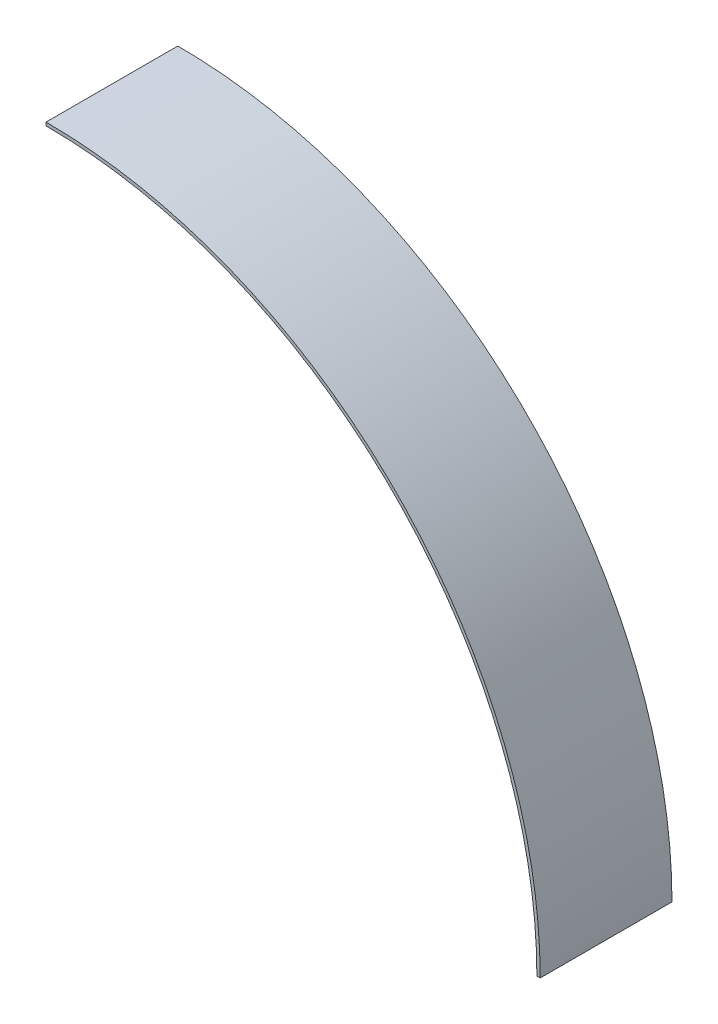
ISO-10303-21;
HEADER;
FILE_DESCRIPTION(('STEP AP214'),'2;1');
FILE_NAME('part.step','',(''),(''),'','','');
FILE_SCHEMA(('AUTOMOTIVE_DESIGN { 1 0 10303 214 1 1 1 1 }'));
ENDSEC;
DATA;
#1=APPLICATION_CONTEXT('core data for automotive mechanical design processes');
#2=APPLICATION_PROTOCOL_DEFINITION('international standard','automotive_design',2000,#1);
#3=PRODUCT_CONTEXT('',#1,'mechanical');
#4=PRODUCT('Part','Part','',(#3));
#5=PRODUCT_RELATED_PRODUCT_CATEGORY('part','',(#4));
#6=PRODUCT_DEFINITION_FORMATION('','',#4);
#7=PRODUCT_DEFINITION_CONTEXT('part definition',#1,'design');
#8=PRODUCT_DEFINITION('design','',#6,#7);
#9=PRODUCT_DEFINITION_SHAPE('','',#8);
#10=(LENGTH_UNIT() NAMED_UNIT(*) SI_UNIT(.MILLI.,.METRE.));
#11=(NAMED_UNIT(*) PLANE_ANGLE_UNIT() SI_UNIT($,.RADIAN.));
#12=(NAMED_UNIT(*) SI_UNIT($,.STERADIAN.) SOLID_ANGLE_UNIT());
#13=UNCERTAINTY_MEASURE_WITH_UNIT(LENGTH_MEASURE(1.E-05),#10,'distance_accuracy_value','');
#14=(GEOMETRIC_REPRESENTATION_CONTEXT(3) GLOBAL_UNCERTAINTY_ASSIGNED_CONTEXT((#13)) GLOBAL_UNIT_ASSIGNED_CONTEXT((#10,
#11,#12)) REPRESENTATION_CONTEXT('',''));
#15=CARTESIAN_POINT('',(0.,0.,0.));
#16=DIRECTION('',(0.,0.,1.));
#17=DIRECTION('',(1.,0.,0.));
#18=AXIS2_PLACEMENT_3D('',#15,#16,#17);
#19=CARTESIAN_POINT('',(0.,0.,20.));
#20=DIRECTION('',(0.,0.,-1.));
#21=DIRECTION('',(-1.,0.,0.));
#22=AXIS2_PLACEMENT_3D('',#19,#20,#21);
#23=CYLINDRICAL_SURFACE('',#22,75.);
#24=CARTESIAN_POINT('',(0.,0.,0.));
#25=DIRECTION('',(0.,0.,1.));
#26=DIRECTION('',(1.,0.,0.));
#27=AXIS2_PLACEMENT_3D('',#24,#25,#26);
#28=CIRCLE('',#27,75.);
#29=CARTESIAN_POINT('',(75.,0.,0.));
#30=VERTEX_POINT('',#29);
#31=CARTESIAN_POINT('',(0.,75.,0.));
#32=VERTEX_POINT('',#31);
#33=EDGE_CURVE('E96',#30,#32,#28,.T.);
#34=ORIENTED_EDGE('',*,*,#33,.T.);
#35=DIRECTION('',(0.,0.,-1.));
#36=VECTOR('',#35,1.);
#37=CARTESIAN_POINT('',(0.,75.,20.));
#38=LINE('',#37,#36);
#39=CARTESIAN_POINT('',(0.,75.,20.));
#40=VERTEX_POINT('',#39);
#41=EDGE_CURVE('E11',#40,#32,#38,.T.);
#42=ORIENTED_EDGE('',*,*,#41,.F.);
#43=CARTESIAN_POINT('',(0.,0.,20.));
#44=DIRECTION('',(0.,0.,1.));
#45=DIRECTION('',(1.,0.,0.));
#46=AXIS2_PLACEMENT_3D('',#43,#44,#45);
#47=CIRCLE('',#46,75.);
#48=CARTESIAN_POINT('',(75.,0.,20.));
#49=VERTEX_POINT('',#48);
#50=EDGE_CURVE('E73',#49,#40,#47,.T.);
#51=ORIENTED_EDGE('',*,*,#50,.F.);
#52=DIRECTION('',(0.,0.,-1.));
#53=VECTOR('',#52,1.);
#54=CARTESIAN_POINT('',(75.,0.,20.));
#55=LINE('',#54,#53);
#56=EDGE_CURVE('E49',#49,#30,#55,.T.);
#57=ORIENTED_EDGE('',*,*,#56,.T.);
#58=EDGE_LOOP('',(#34,#42,#51,#57));
#59=FACE_BOUND('',#58,.T.);
#60=ADVANCED_FACE('F33',(#59),#23,.T.);
#61=CARTESIAN_POINT('',(0.,74.5,20.));
#62=DIRECTION('',(-1.,0.,0.));
#63=DIRECTION('',(0.,-1.,0.));
#64=AXIS2_PLACEMENT_3D('',#61,#62,#63);
#65=PLANE('',#64);
#66=DIRECTION('',(0.,1.,0.));
#67=VECTOR('',#66,1.);
#68=CARTESIAN_POINT('',(0.,74.5,0.));
#69=LINE('',#68,#67);
#70=CARTESIAN_POINT('',(0.,74.5,0.));
#71=VERTEX_POINT('',#70);
#72=EDGE_CURVE('E82',#71,#32,#69,.T.);
#73=ORIENTED_EDGE('',*,*,#72,.F.);
#74=DIRECTION('',(0.,0.,-1.));
#75=VECTOR('',#74,1.);
#76=CARTESIAN_POINT('',(0.,74.5,20.));
#77=LINE('',#76,#75);
#78=CARTESIAN_POINT('',(0.,74.5,20.));
#79=VERTEX_POINT('',#78);
#80=EDGE_CURVE('E41',#79,#71,#77,.T.);
#81=ORIENTED_EDGE('',*,*,#80,.F.);
#82=DIRECTION('',(0.,1.,0.));
#83=VECTOR('',#82,1.);
#84=CARTESIAN_POINT('',(0.,74.5,20.));
#85=LINE('',#84,#83);
#86=EDGE_CURVE('E80',#79,#40,#85,.T.);
#87=ORIENTED_EDGE('',*,*,#86,.T.);
#88=ORIENTED_EDGE('',*,*,#41,.T.);
#89=EDGE_LOOP('',(#73,#81,#87,#88));
#90=FACE_BOUND('',#89,.T.);
#91=ADVANCED_FACE('F79',(#90),#65,.T.);
#92=CARTESIAN_POINT('',(0.,0.,20.));
#93=DIRECTION('',(0.,0.,-1.));
#94=DIRECTION('',(-1.,0.,0.));
#95=AXIS2_PLACEMENT_3D('',#92,#93,#94);
#96=CYLINDRICAL_SURFACE('',#95,74.5);
#97=CARTESIAN_POINT('',(0.,0.,0.));
#98=DIRECTION('',(0.,0.,1.));
#99=DIRECTION('',(1.,0.,0.));
#100=AXIS2_PLACEMENT_3D('',#97,#98,#99);
#101=CIRCLE('',#100,74.5);
#102=CARTESIAN_POINT('',(74.5,0.,0.));
#103=VERTEX_POINT('',#102);
#104=EDGE_CURVE('E99',#103,#71,#101,.T.);
#105=ORIENTED_EDGE('',*,*,#104,.F.);
#106=DIRECTION('',(0.,0.,-1.));
#107=VECTOR('',#106,1.);
#108=CARTESIAN_POINT('',(74.5,0.,20.));
#109=LINE('',#108,#107);
#110=CARTESIAN_POINT('',(74.5,0.,20.));
#111=VERTEX_POINT('',#110);
#112=EDGE_CURVE('E62',#111,#103,#109,.T.);
#113=ORIENTED_EDGE('',*,*,#112,.F.);
#114=CARTESIAN_POINT('',(0.,0.,20.));
#115=DIRECTION('',(0.,0.,1.));
#116=DIRECTION('',(1.,0.,0.));
#117=AXIS2_PLACEMENT_3D('',#114,#115,#116);
#118=CIRCLE('',#117,74.5);
#119=EDGE_CURVE('E88',#111,#79,#118,.T.);
#120=ORIENTED_EDGE('',*,*,#119,.T.);
#121=ORIENTED_EDGE('',*,*,#80,.T.);
#122=EDGE_LOOP('',(#105,#113,#120,#121));
#123=FACE_BOUND('',#122,.T.);
#124=ADVANCED_FACE('F90',(#123),#96,.F.);
#125=CARTESIAN_POINT('',(75.,0.,20.));
#126=DIRECTION('',(0.,-1.,0.));
#127=DIRECTION('',(0.,0.,-1.));
#128=AXIS2_PLACEMENT_3D('',#125,#126,#127);
#129=PLANE('',#128);
#130=DIRECTION('',(-1.,0.,0.));
#131=VECTOR('',#130,1.);
#132=CARTESIAN_POINT('',(75.,0.,0.));
#133=LINE('',#132,#131);
#134=EDGE_CURVE('E101',#30,#103,#133,.T.);
#135=ORIENTED_EDGE('',*,*,#134,.F.);
#136=ORIENTED_EDGE('',*,*,#56,.F.);
#137=DIRECTION('',(-1.,0.,0.));
#138=VECTOR('',#137,1.);
#139=CARTESIAN_POINT('',(75.,0.,20.));
#140=LINE('',#139,#138);
#141=EDGE_CURVE('E91',#49,#111,#140,.T.);
#142=ORIENTED_EDGE('',*,*,#141,.T.);
#143=ORIENTED_EDGE('',*,*,#112,.T.);
#144=EDGE_LOOP('',(#135,#136,#142,#143));
#145=FACE_BOUND('',#144,.T.);
#146=ADVANCED_FACE('F107',(#145),#129,.T.);
#147=CARTESIAN_POINT('',(0.,0.,20.));
#148=DIRECTION('',(0.,0.,1.));
#149=DIRECTION('',(1.,0.,0.));
#150=AXIS2_PLACEMENT_3D('',#147,#148,#149);
#151=PLANE('',#150);
#152=ORIENTED_EDGE('',*,*,#50,.T.);
#153=ORIENTED_EDGE('',*,*,#86,.F.);
#154=ORIENTED_EDGE('',*,*,#119,.F.);
#155=ORIENTED_EDGE('',*,*,#141,.F.);
#156=EDGE_LOOP('',(#152,#153,#154,#155));
#157=FACE_BOUND('',#156,.T.);
#158=ADVANCED_FACE('F87',(#157),#151,.T.);
#159=CARTESIAN_POINT('',(0.,0.,0.));
#160=DIRECTION('',(0.,0.,1.));
#161=DIRECTION('',(1.,0.,0.));
#162=AXIS2_PLACEMENT_3D('',#159,#160,#161);
#163=PLANE('',#162);
#164=ORIENTED_EDGE('',*,*,#33,.F.);
#165=ORIENTED_EDGE('',*,*,#134,.T.);
#166=ORIENTED_EDGE('',*,*,#104,.T.);
#167=ORIENTED_EDGE('',*,*,#72,.T.);
#168=EDGE_LOOP('',(#164,#165,#166,#167));
#169=FACE_BOUND('',#168,.T.);
#170=ADVANCED_FACE('F106',(#169),#163,.F.);
#171=CLOSED_SHELL('',(#60,#91,#124,#146,#158,#170));
#172=MANIFOLD_SOLID_BREP('B2',#171);
#173=ADVANCED_BREP_SHAPE_REPRESENTATION('',(#18,#172),#14);
#174=SHAPE_DEFINITION_REPRESENTATION(#9,#173);
ENDSEC;
END-ISO-10303-21;
